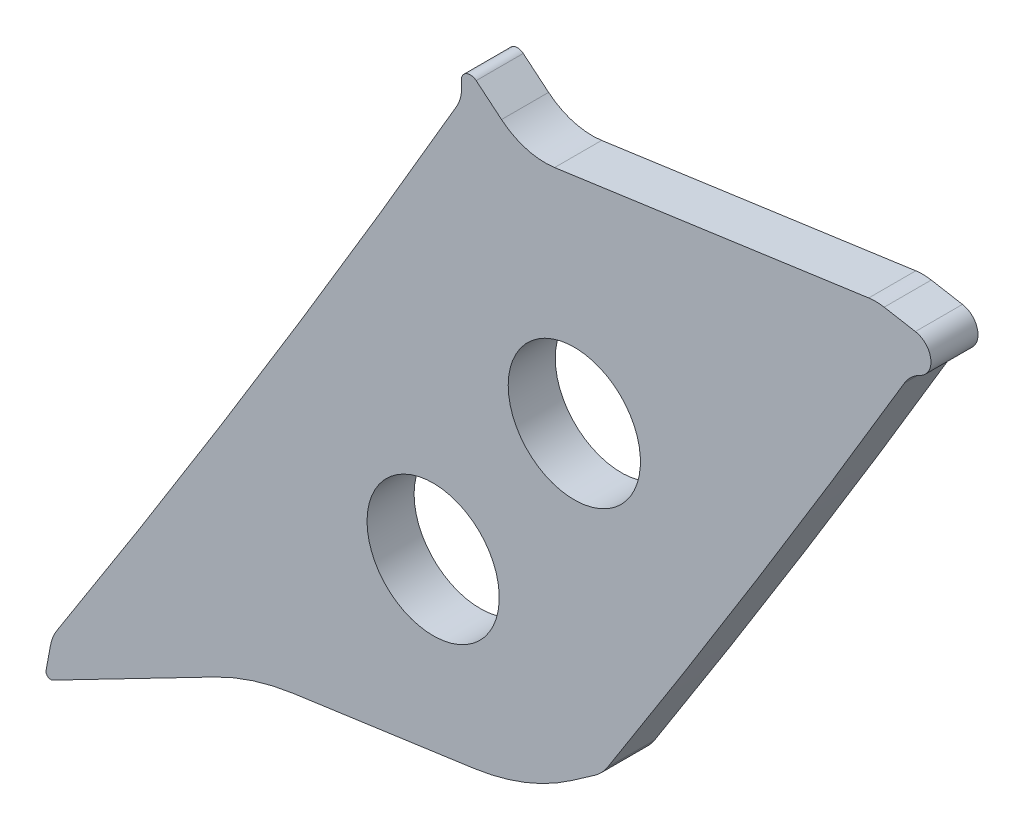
ISO-10303-21;
HEADER;
FILE_DESCRIPTION(('STEP AP214'),'2;1');
FILE_NAME('part.step','',(''),(''),'','','');
FILE_SCHEMA(('AUTOMOTIVE_DESIGN { 1 0 10303 214 1 1 1 1 }'));
ENDSEC;
DATA;
#1=APPLICATION_CONTEXT('core data for automotive mechanical design processes');
#2=APPLICATION_PROTOCOL_DEFINITION('international standard','automotive_design',2000,#1);
#3=PRODUCT_CONTEXT('',#1,'mechanical');
#4=PRODUCT('Part','Part','',(#3));
#5=PRODUCT_RELATED_PRODUCT_CATEGORY('part','',(#4));
#6=PRODUCT_DEFINITION_FORMATION('','',#4);
#7=PRODUCT_DEFINITION_CONTEXT('part definition',#1,'design');
#8=PRODUCT_DEFINITION('design','',#6,#7);
#9=PRODUCT_DEFINITION_SHAPE('','',#8);
#10=(LENGTH_UNIT() NAMED_UNIT(*) SI_UNIT(.MILLI.,.METRE.));
#11=(NAMED_UNIT(*) PLANE_ANGLE_UNIT() SI_UNIT($,.RADIAN.));
#12=(NAMED_UNIT(*) SI_UNIT($,.STERADIAN.) SOLID_ANGLE_UNIT());
#13=UNCERTAINTY_MEASURE_WITH_UNIT(LENGTH_MEASURE(1.E-05),#10,'distance_accuracy_value','');
#14=(GEOMETRIC_REPRESENTATION_CONTEXT(3) GLOBAL_UNCERTAINTY_ASSIGNED_CONTEXT((#13)) GLOBAL_UNIT_ASSIGNED_CONTEXT((#10,
#11,#12)) REPRESENTATION_CONTEXT('',''));
#15=CARTESIAN_POINT('',(0.,0.,0.));
#16=DIRECTION('',(0.,0.,1.));
#17=DIRECTION('',(1.,0.,0.));
#18=AXIS2_PLACEMENT_3D('',#15,#16,#17);
#19=CARTESIAN_POINT('',(-1653.91646147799,487.596028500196,0.));
#20=DIRECTION('',(0.,0.,1.));
#21=DIRECTION('',(1.,0.,0.));
#22=AXIS2_PLACEMENT_3D('',#19,#20,#21);
#23=PLANE('',#22);
#24=CARTESIAN_POINT('',(-904.24,45.72,0.));
#25=DIRECTION('',(0.,0.,-1.));
#26=DIRECTION('',(-1.,0.,0.));
#27=AXIS2_PLACEMENT_3D('',#24,#25,#26);
#28=CIRCLE('',#27,3.56869999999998);
#29=CARTESIAN_POINT('',(-907.8087,45.72,0.));
#30=VERTEX_POINT('',#29);
#31=EDGE_CURVE('E385',#30,#30,#28,.T.);
#32=ORIENTED_EDGE('',*,*,#31,.T.);
#33=EDGE_LOOP('',(#32));
#34=FACE_BOUND('',#33,.T.);
#35=CARTESIAN_POINT('',(-1653.91646147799,487.596028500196,0.));
#36=DIRECTION('',(0.,0.,-1.));
#37=DIRECTION('',(1.,0.,0.));
#38=AXIS2_PLACEMENT_3D('',#35,#36,#37);
#39=CIRCLE('',#38,858.850398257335);
#40=CARTESIAN_POINT('',(-910.59376540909,57.3689069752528,0.));
#41=VERTEX_POINT('',#40);
#42=CARTESIAN_POINT('',(-932.158261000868,22.0972566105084,0.));
#43=VERTEX_POINT('',#42);
#44=EDGE_CURVE('E223',#41,#43,#39,.T.);
#45=ORIENTED_EDGE('',*,*,#44,.T.);
#46=CARTESIAN_POINT('',(-930.023703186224,20.7205711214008,0.));
#47=DIRECTION('',(0.,0.,1.));
#48=DIRECTION('',(1.,0.,0.));
#49=AXIS2_PLACEMENT_3D('',#46,#47,#48);
#50=CIRCLE('',#49,2.53999999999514);
#51=CARTESIAN_POINT('',(-932.521499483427,21.1816716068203,0.));
#52=VERTEX_POINT('',#51);
#53=EDGE_CURVE('E227',#43,#52,#50,.T.);
#54=ORIENTED_EDGE('',*,*,#53,.T.);
#55=DIRECTION('',(-0.181535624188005,-0.98338436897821,0.));
#56=VECTOR('',#55,1.);
#57=CARTESIAN_POINT('',(-932.521499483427,21.1816716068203,0.));
#58=LINE('',#57,#56);
#59=CARTESIAN_POINT('',(-932.753780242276,19.9233991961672,0.));
#60=VERTEX_POINT('',#59);
#61=EDGE_CURVE('E232',#52,#60,#58,.T.);
#62=ORIENTED_EDGE('',*,*,#61,.T.);
#63=CARTESIAN_POINT('',(-932.504000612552,19.877289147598,0.));
#64=DIRECTION('',(0.,0.,1.));
#65=DIRECTION('',(1.,0.,0.));
#66=AXIS2_PLACEMENT_3D('',#63,#64,#65);
#67=CIRCLE('',#66,0.254000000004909);
#68=CARTESIAN_POINT('',(-932.387397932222,19.6516349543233,0.));
#69=VERTEX_POINT('',#68);
#70=EDGE_CURVE('E236',#60,#69,#67,.T.);
#71=ORIENTED_EDGE('',*,*,#70,.T.);
#72=DIRECTION('',(0.888402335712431,0.459065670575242,0.));
#73=VECTOR('',#72,1.);
#74=CARTESIAN_POINT('',(-932.387397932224,19.6516349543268,0.));
#75=LINE('',#74,#73);
#76=CARTESIAN_POINT('',(-923.637335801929,24.1730696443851,0.));
#77=VERTEX_POINT('',#76);
#78=EDGE_CURVE('E240',#69,#77,#75,.T.);
#79=ORIENTED_EDGE('',*,*,#78,.T.);
#80=CARTESIAN_POINT('',(-917.573996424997,12.439051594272,0.));
#81=DIRECTION('',(0.,0.,-1.));
#82=DIRECTION('',(1.,0.,0.));
#83=AXIS2_PLACEMENT_3D('',#80,#81,#82);
#84=CIRCLE('',#83,13.208000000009);
#85=CARTESIAN_POINT('',(-919.412194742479,25.5185122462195,0.));
#86=VERTEX_POINT('',#85);
#87=EDGE_CURVE('E244',#77,#86,#84,.T.);
#88=ORIENTED_EDGE('',*,*,#87,.T.);
#89=DIRECTION('',(0.990268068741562,0.139173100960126,0.));
#90=VECTOR('',#89,1.);
#91=CARTESIAN_POINT('',(-919.412194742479,25.5185122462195,0.));
#92=LINE('',#91,#90);
#93=CARTESIAN_POINT('',(-909.658835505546,26.8892574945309,0.));
#94=VERTEX_POINT('',#93);
#95=EDGE_CURVE('E248',#86,#94,#92,.T.);
#96=ORIENTED_EDGE('',*,*,#95,.T.);
#97=CARTESIAN_POINT('',(-911.355633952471,38.9626057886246,0.));
#98=DIRECTION('',(0.,0.,1.));
#99=DIRECTION('',(1.,0.,0.));
#100=AXIS2_PLACEMENT_3D('',#97,#98,#99);
#101=CIRCLE('',#100,12.1920000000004);
#102=CARTESIAN_POINT('',(-904.388794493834,28.9572066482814,0.));
#103=VERTEX_POINT('',#102);
#104=EDGE_CURVE('E252',#94,#103,#101,.T.);
#105=ORIENTED_EDGE('',*,*,#104,.T.);
#106=DIRECTION('',(0.82065281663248,0.571427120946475,0.));
#107=VECTOR('',#106,1.);
#108=CARTESIAN_POINT('',(-904.388794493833,28.9572066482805,0.));
#109=LINE('',#108,#107);
#110=CARTESIAN_POINT('',(-903.138119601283,29.8280615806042,0.));
#111=VERTEX_POINT('',#110);
#112=EDGE_CURVE('E256',#103,#111,#109,.T.);
#113=ORIENTED_EDGE('',*,*,#112,.T.);
#114=CARTESIAN_POINT('',(-904.589544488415,31.912519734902,0.));
#115=DIRECTION('',(0.,0.,1.));
#116=DIRECTION('',(1.,0.,0.));
#117=AXIS2_PLACEMENT_3D('',#114,#115,#116);
#118=CIRCLE('',#117,2.54000000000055);
#119=CARTESIAN_POINT('',(-902.452304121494,30.5400024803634,0.));
#120=VERTEX_POINT('',#119);
#121=EDGE_CURVE('E260',#111,#120,#118,.T.);
#122=ORIENTED_EDGE('',*,*,#121,.T.);
#123=CARTESIAN_POINT('',(-1614.16546147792,487.596028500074,0.));
#124=DIRECTION('',(0.,0.,1.));
#125=DIRECTION('',(1.,0.,0.));
#126=AXIS2_PLACEMENT_3D('',#123,#124,#125);
#127=CIRCLE('',#126,845.834398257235);
#128=CARTESIAN_POINT('',(-886.424246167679,56.5176680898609,0.));
#129=VERTEX_POINT('',#128);
#130=EDGE_CURVE('E264',#120,#129,#127,.T.);
#131=ORIENTED_EDGE('',*,*,#130,.T.);
#132=CARTESIAN_POINT('',(-884.675948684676,55.4820620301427,0.));
#133=DIRECTION('',(0.,0.,-1.));
#134=DIRECTION('',(1.,0.,0.));
#135=AXIS2_PLACEMENT_3D('',#132,#133,#134);
#136=CIRCLE('',#135,2.03199999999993);
#137=CARTESIAN_POINT('',(-885.56222905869,57.3105945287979,0.));
#138=VERTEX_POINT('',#137);
#139=EDGE_CURVE('E268',#129,#138,#136,.T.);
#140=ORIENTED_EDGE('',*,*,#139,.T.);
#141=CARTESIAN_POINT('',(-886.005369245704,58.2248607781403,0.));
#142=DIRECTION('',(0.,0.,1.));
#143=DIRECTION('',(1.,0.,0.));
#144=AXIS2_PLACEMENT_3D('',#141,#142,#143);
#145=CIRCLE('',#144,1.01600000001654);
#146=CARTESIAN_POINT('',(-885.828942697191,59.225425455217,0.));
#147=VERTEX_POINT('',#146);
#148=EDGE_CURVE('E272',#138,#147,#145,.T.);
#149=ORIENTED_EDGE('',*,*,#148,.T.);
#150=DIRECTION('',(-0.984807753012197,0.173648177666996,0.));
#151=VECTOR('',#150,1.);
#152=CARTESIAN_POINT('',(-885.828942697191,59.225425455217,0.));
#153=LINE('',#152,#151);
#154=CARTESIAN_POINT('',(-887.513635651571,59.5224822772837,0.));
#155=VERTEX_POINT('',#154);
#156=EDGE_CURVE('E276',#147,#155,#153,.T.);
#157=ORIENTED_EDGE('',*,*,#156,.T.);
#158=CARTESIAN_POINT('',(-887.976755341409,56.896,0.));
#159=DIRECTION('',(0.,0.,1.));
#160=DIRECTION('',(1.,0.,0.));
#161=AXIS2_PLACEMENT_3D('',#158,#159,#160);
#162=CIRCLE('',#161,2.66700000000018);
#163=CARTESIAN_POINT('',(-888.34793000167,59.537044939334,0.));
#164=VERTEX_POINT('',#163);
#165=EDGE_CURVE('E280',#155,#164,#162,.T.);
#166=ORIENTED_EDGE('',*,*,#165,.T.);
#167=DIRECTION('',(-0.990268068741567,-0.139173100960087,0.));
#168=VECTOR('',#167,1.);
#169=CARTESIAN_POINT('',(-888.34793000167,59.5370449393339,0.));
#170=LINE('',#169,#168);
#171=CARTESIAN_POINT('',(-905.304187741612,57.1539983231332,0.));
#172=VERTEX_POINT('',#171);
#173=EDGE_CURVE('E284',#164,#172,#170,.T.);
#174=ORIENTED_EDGE('',*,*,#173,.T.);
#175=CARTESIAN_POINT('',(-905.816762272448,60.8011556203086,0.));
#176=DIRECTION('',(0.,0.,-1.));
#177=DIRECTION('',(1.,0.,0.));
#178=AXIS2_PLACEMENT_3D('',#175,#176,#177);
#179=CIRCLE('',#178,3.68299999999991);
#180=CARTESIAN_POINT('',(-908.168482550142,57.9667419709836,0.));
#181=VERTEX_POINT('',#180);
#182=EDGE_CURVE('E288',#172,#181,#179,.T.);
#183=ORIENTED_EDGE('',*,*,#182,.T.);
#184=DIRECTION('',(-0.769593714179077,0.638533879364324,0.));
#185=VECTOR('',#184,1.);
#186=CARTESIAN_POINT('',(-908.168482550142,57.9667419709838,0.));
#187=LINE('',#186,#185);
#188=CARTESIAN_POINT('',(-909.536820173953,59.1020552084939,0.));
#189=VERTEX_POINT('',#188);
#190=EDGE_CURVE('E292',#181,#189,#187,.T.);
#191=ORIENTED_EDGE('',*,*,#190,.T.);
#192=CARTESIAN_POINT('',(-909.850978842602,58.7234151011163,0.));
#193=DIRECTION('',(0.,0.,1.));
#194=DIRECTION('',(1.,0.,0.));
#195=AXIS2_PLACEMENT_3D('',#192,#193,#194);
#196=CIRCLE('',#195,0.492000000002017);
#197=CARTESIAN_POINT('',(-910.33858386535,58.6577999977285,0.));
#198=VERTEX_POINT('',#197);
#199=EDGE_CURVE('E193',#189,#198,#196,.T.);
#200=ORIENTED_EDGE('',*,*,#199,.T.);
#201=CARTESIAN_POINT('',(-912.35243225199,58.3868042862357,0.));
#202=DIRECTION('',(0.,0.,-1.));
#203=DIRECTION('',(1.,0.,0.));
#204=AXIS2_PLACEMENT_3D('',#201,#202,#203);
#205=CIRCLE('',#204,2.03200000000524);
#206=EDGE_CURVE('E297',#198,#41,#205,.T.);
#207=ORIENTED_EDGE('',*,*,#206,.T.);
#208=EDGE_LOOP('',(#45,#54,#62,#71,#79,#88,#96,#105,#113,#122,#131,#140,#149,#157,#166,#174,
#183,#191,#200,#207));
#209=FACE_BOUND('',#208,.T.);
#210=CARTESIAN_POINT('',(-911.86,35.56,0.));
#211=DIRECTION('',(0.,0.,-1.));
#212=DIRECTION('',(-1.,0.,0.));
#213=AXIS2_PLACEMENT_3D('',#210,#211,#212);
#214=CIRCLE('',#213,3.56869999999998);
#215=CARTESIAN_POINT('',(-915.4287,35.56,0.));
#216=VERTEX_POINT('',#215);
#217=EDGE_CURVE('E390',#216,#216,#214,.T.);
#218=ORIENTED_EDGE('',*,*,#217,.T.);
#219=EDGE_LOOP('',(#218));
#220=FACE_BOUND('',#219,.T.);
#221=ADVANCED_FACE('F45',(#34,#209,#220),#23,.T.);
#222=CARTESIAN_POINT('',(-1653.91646147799,487.596028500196,-2.54));
#223=DIRECTION('',(0.,0.,1.));
#224=DIRECTION('',(1.,0.,0.));
#225=AXIS2_PLACEMENT_3D('',#222,#223,#224);
#226=PLANE('',#225);
#227=CARTESIAN_POINT('',(-904.24,45.72,-2.54));
#228=DIRECTION('',(0.,0.,-1.));
#229=DIRECTION('',(-1.,0.,0.));
#230=AXIS2_PLACEMENT_3D('',#227,#228,#229);
#231=CIRCLE('',#230,3.56869999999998);
#232=CARTESIAN_POINT('',(-907.8087,45.72,-2.54));
#233=VERTEX_POINT('',#232);
#234=EDGE_CURVE('E388',#233,#233,#231,.T.);
#235=ORIENTED_EDGE('',*,*,#234,.F.);
#236=EDGE_LOOP('',(#235));
#237=FACE_BOUND('',#236,.T.);
#238=CARTESIAN_POINT('',(-1653.91646147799,487.596028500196,-2.54));
#239=DIRECTION('',(0.,0.,-1.));
#240=DIRECTION('',(1.,0.,0.));
#241=AXIS2_PLACEMENT_3D('',#238,#239,#240);
#242=CIRCLE('',#241,858.850398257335);
#243=CARTESIAN_POINT('',(-910.59376540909,57.3689069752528,-2.54));
#244=VERTEX_POINT('',#243);
#245=CARTESIAN_POINT('',(-932.158261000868,22.0972566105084,-2.54));
#246=VERTEX_POINT('',#245);
#247=EDGE_CURVE('E300',#244,#246,#242,.T.);
#248=ORIENTED_EDGE('',*,*,#247,.F.);
#249=CARTESIAN_POINT('',(-912.35243225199,58.3868042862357,-2.54));
#250=DIRECTION('',(0.,0.,-1.));
#251=DIRECTION('',(1.,0.,0.));
#252=AXIS2_PLACEMENT_3D('',#249,#250,#251);
#253=CIRCLE('',#252,2.03200000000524);
#254=CARTESIAN_POINT('',(-910.33858386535,58.6577999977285,-2.54));
#255=VERTEX_POINT('',#254);
#256=EDGE_CURVE('E208',#255,#244,#253,.T.);
#257=ORIENTED_EDGE('',*,*,#256,.F.);
#258=CARTESIAN_POINT('',(-909.850978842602,58.7234151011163,-2.54));
#259=DIRECTION('',(0.,0.,1.));
#260=DIRECTION('',(1.,0.,0.));
#261=AXIS2_PLACEMENT_3D('',#258,#259,#260);
#262=CIRCLE('',#261,0.492000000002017);
#263=CARTESIAN_POINT('',(-909.536820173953,59.1020552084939,-2.54));
#264=VERTEX_POINT('',#263);
#265=EDGE_CURVE('E191',#264,#255,#262,.T.);
#266=ORIENTED_EDGE('',*,*,#265,.F.);
#267=DIRECTION('',(-0.769593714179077,0.638533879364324,0.));
#268=VECTOR('',#267,1.);
#269=CARTESIAN_POINT('',(-908.168482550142,57.9667419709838,-2.54));
#270=LINE('',#269,#268);
#271=CARTESIAN_POINT('',(-908.168482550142,57.9667419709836,-2.54));
#272=VERTEX_POINT('',#271);
#273=EDGE_CURVE('E206',#272,#264,#270,.T.);
#274=ORIENTED_EDGE('',*,*,#273,.F.);
#275=CARTESIAN_POINT('',(-905.816762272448,60.8011556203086,-2.54));
#276=DIRECTION('',(0.,0.,-1.));
#277=DIRECTION('',(1.,0.,0.));
#278=AXIS2_PLACEMENT_3D('',#275,#276,#277);
#279=CIRCLE('',#278,3.68299999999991);
#280=CARTESIAN_POINT('',(-905.304187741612,57.1539983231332,-2.54));
#281=VERTEX_POINT('',#280);
#282=EDGE_CURVE('E213',#281,#272,#279,.T.);
#283=ORIENTED_EDGE('',*,*,#282,.F.);
#284=DIRECTION('',(-0.990268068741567,-0.139173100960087,0.));
#285=VECTOR('',#284,1.);
#286=CARTESIAN_POINT('',(-888.34793000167,59.5370449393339,-2.54));
#287=LINE('',#286,#285);
#288=CARTESIAN_POINT('',(-888.34793000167,59.537044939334,-2.54));
#289=VERTEX_POINT('',#288);
#290=EDGE_CURVE('E217',#289,#281,#287,.T.);
#291=ORIENTED_EDGE('',*,*,#290,.F.);
#292=CARTESIAN_POINT('',(-887.976755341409,56.896,-2.54));
#293=DIRECTION('',(0.,0.,1.));
#294=DIRECTION('',(1.,0.,0.));
#295=AXIS2_PLACEMENT_3D('',#292,#293,#294);
#296=CIRCLE('',#295,2.66700000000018);
#297=CARTESIAN_POINT('',(-887.513635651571,59.5224822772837,-2.54));
#298=VERTEX_POINT('',#297);
#299=EDGE_CURVE('E455',#298,#289,#296,.T.);
#300=ORIENTED_EDGE('',*,*,#299,.F.);
#301=DIRECTION('',(-0.984807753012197,0.173648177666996,0.));
#302=VECTOR('',#301,1.);
#303=CARTESIAN_POINT('',(-885.828942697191,59.225425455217,-2.54));
#304=LINE('',#303,#302);
#305=CARTESIAN_POINT('',(-885.828942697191,59.225425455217,-2.54));
#306=VERTEX_POINT('',#305);
#307=EDGE_CURVE('E451',#306,#298,#304,.T.);
#308=ORIENTED_EDGE('',*,*,#307,.F.);
#309=CARTESIAN_POINT('',(-886.005369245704,58.2248607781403,-2.54));
#310=DIRECTION('',(0.,0.,1.));
#311=DIRECTION('',(1.,0.,0.));
#312=AXIS2_PLACEMENT_3D('',#309,#310,#311);
#313=CIRCLE('',#312,1.01600000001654);
#314=CARTESIAN_POINT('',(-885.56222905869,57.3105945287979,-2.54));
#315=VERTEX_POINT('',#314);
#316=EDGE_CURVE('E447',#315,#306,#313,.T.);
#317=ORIENTED_EDGE('',*,*,#316,.F.);
#318=CARTESIAN_POINT('',(-884.675948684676,55.4820620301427,-2.54));
#319=DIRECTION('',(0.,0.,-1.));
#320=DIRECTION('',(1.,0.,0.));
#321=AXIS2_PLACEMENT_3D('',#318,#319,#320);
#322=CIRCLE('',#321,2.03199999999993);
#323=CARTESIAN_POINT('',(-886.424246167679,56.5176680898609,-2.54));
#324=VERTEX_POINT('',#323);
#325=EDGE_CURVE('E443',#324,#315,#322,.T.);
#326=ORIENTED_EDGE('',*,*,#325,.F.);
#327=CARTESIAN_POINT('',(-1614.16546147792,487.596028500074,-2.54));
#328=DIRECTION('',(0.,0.,1.));
#329=DIRECTION('',(1.,0.,0.));
#330=AXIS2_PLACEMENT_3D('',#327,#328,#329);
#331=CIRCLE('',#330,845.834398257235);
#332=CARTESIAN_POINT('',(-902.452304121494,30.5400024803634,-2.54));
#333=VERTEX_POINT('',#332);
#334=EDGE_CURVE('E439',#333,#324,#331,.T.);
#335=ORIENTED_EDGE('',*,*,#334,.F.);
#336=CARTESIAN_POINT('',(-904.589544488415,31.912519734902,-2.54));
#337=DIRECTION('',(0.,0.,1.));
#338=DIRECTION('',(1.,0.,0.));
#339=AXIS2_PLACEMENT_3D('',#336,#337,#338);
#340=CIRCLE('',#339,2.54000000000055);
#341=CARTESIAN_POINT('',(-903.138119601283,29.8280615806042,-2.54));
#342=VERTEX_POINT('',#341);
#343=EDGE_CURVE('E435',#342,#333,#340,.T.);
#344=ORIENTED_EDGE('',*,*,#343,.F.);
#345=DIRECTION('',(0.82065281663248,0.571427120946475,0.));
#346=VECTOR('',#345,1.);
#347=CARTESIAN_POINT('',(-904.388794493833,28.9572066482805,-2.54));
#348=LINE('',#347,#346);
#349=CARTESIAN_POINT('',(-904.388794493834,28.9572066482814,-2.54));
#350=VERTEX_POINT('',#349);
#351=EDGE_CURVE('E431',#350,#342,#348,.T.);
#352=ORIENTED_EDGE('',*,*,#351,.F.);
#353=CARTESIAN_POINT('',(-911.355633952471,38.9626057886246,-2.54));
#354=DIRECTION('',(0.,0.,1.));
#355=DIRECTION('',(1.,0.,0.));
#356=AXIS2_PLACEMENT_3D('',#353,#354,#355);
#357=CIRCLE('',#356,12.1920000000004);
#358=CARTESIAN_POINT('',(-909.658835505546,26.8892574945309,-2.54));
#359=VERTEX_POINT('',#358);
#360=EDGE_CURVE('E427',#359,#350,#357,.T.);
#361=ORIENTED_EDGE('',*,*,#360,.F.);
#362=DIRECTION('',(0.990268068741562,0.139173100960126,0.));
#363=VECTOR('',#362,1.);
#364=CARTESIAN_POINT('',(-919.412194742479,25.5185122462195,-2.54));
#365=LINE('',#364,#363);
#366=CARTESIAN_POINT('',(-919.412194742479,25.5185122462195,-2.54));
#367=VERTEX_POINT('',#366);
#368=EDGE_CURVE('E423',#367,#359,#365,.T.);
#369=ORIENTED_EDGE('',*,*,#368,.F.);
#370=CARTESIAN_POINT('',(-917.573996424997,12.439051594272,-2.54));
#371=DIRECTION('',(0.,0.,-1.));
#372=DIRECTION('',(1.,0.,0.));
#373=AXIS2_PLACEMENT_3D('',#370,#371,#372);
#374=CIRCLE('',#373,13.208000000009);
#375=CARTESIAN_POINT('',(-923.637335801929,24.1730696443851,-2.54));
#376=VERTEX_POINT('',#375);
#377=EDGE_CURVE('E419',#376,#367,#374,.T.);
#378=ORIENTED_EDGE('',*,*,#377,.F.);
#379=DIRECTION('',(0.888402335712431,0.459065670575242,0.));
#380=VECTOR('',#379,1.);
#381=CARTESIAN_POINT('',(-932.387397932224,19.6516349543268,-2.54));
#382=LINE('',#381,#380);
#383=CARTESIAN_POINT('',(-932.387397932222,19.6516349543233,-2.54));
#384=VERTEX_POINT('',#383);
#385=EDGE_CURVE('E415',#384,#376,#382,.T.);
#386=ORIENTED_EDGE('',*,*,#385,.F.);
#387=CARTESIAN_POINT('',(-932.504000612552,19.877289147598,-2.54));
#388=DIRECTION('',(0.,0.,1.));
#389=DIRECTION('',(1.,0.,0.));
#390=AXIS2_PLACEMENT_3D('',#387,#388,#389);
#391=CIRCLE('',#390,0.254000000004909);
#392=CARTESIAN_POINT('',(-932.753780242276,19.9233991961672,-2.54));
#393=VERTEX_POINT('',#392);
#394=EDGE_CURVE('E411',#393,#384,#391,.T.);
#395=ORIENTED_EDGE('',*,*,#394,.F.);
#396=DIRECTION('',(-0.181535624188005,-0.98338436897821,0.));
#397=VECTOR('',#396,1.);
#398=CARTESIAN_POINT('',(-932.521499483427,21.1816716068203,-2.54));
#399=LINE('',#398,#397);
#400=CARTESIAN_POINT('',(-932.521499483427,21.1816716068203,-2.54));
#401=VERTEX_POINT('',#400);
#402=EDGE_CURVE('E407',#401,#393,#399,.T.);
#403=ORIENTED_EDGE('',*,*,#402,.F.);
#404=CARTESIAN_POINT('',(-930.023703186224,20.7205711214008,-2.54));
#405=DIRECTION('',(0.,0.,1.));
#406=DIRECTION('',(1.,0.,0.));
#407=AXIS2_PLACEMENT_3D('',#404,#405,#406);
#408=CIRCLE('',#407,2.53999999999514);
#409=EDGE_CURVE('E404',#246,#401,#408,.T.);
#410=ORIENTED_EDGE('',*,*,#409,.F.);
#411=EDGE_LOOP('',(#248,#257,#266,#274,#283,#291,#300,#308,#317,#326,#335,#344,#352,#361,#369,
#378,#386,#395,#403,#410));
#412=FACE_BOUND('',#411,.T.);
#413=CARTESIAN_POINT('',(-911.86,35.56,-2.54));
#414=DIRECTION('',(0.,0.,-1.));
#415=DIRECTION('',(-1.,0.,0.));
#416=AXIS2_PLACEMENT_3D('',#413,#414,#415);
#417=CIRCLE('',#416,3.56869999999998);
#418=CARTESIAN_POINT('',(-915.4287,35.56,-2.54));
#419=VERTEX_POINT('',#418);
#420=EDGE_CURVE('E228',#419,#419,#417,.T.);
#421=ORIENTED_EDGE('',*,*,#420,.F.);
#422=EDGE_LOOP('',(#421));
#423=FACE_BOUND('',#422,.T.);
#424=ADVANCED_FACE('F203',(#237,#412,#423),#226,.F.);
#425=CARTESIAN_POINT('',(-1653.91646147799,487.596028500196,-2.54));
#426=DIRECTION('',(0.,0.,1.));
#427=DIRECTION('',(1.,0.,0.));
#428=AXIS2_PLACEMENT_3D('',#425,#426,#427);
#429=CYLINDRICAL_SURFACE('',#428,858.850398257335);
#430=ORIENTED_EDGE('',*,*,#44,.F.);
#431=DIRECTION('',(0.,0.,1.));
#432=VECTOR('',#431,1.);
#433=CARTESIAN_POINT('',(-910.59376540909,57.3689069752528,-2.54));
#434=LINE('',#433,#432);
#435=EDGE_CURVE('E11',#244,#41,#434,.T.);
#436=ORIENTED_EDGE('',*,*,#435,.F.);
#437=ORIENTED_EDGE('',*,*,#247,.T.);
#438=DIRECTION('',(0.,0.,1.));
#439=VECTOR('',#438,1.);
#440=CARTESIAN_POINT('',(-932.158261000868,22.0972566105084,-2.54));
#441=LINE('',#440,#439);
#442=EDGE_CURVE('E49',#246,#43,#441,.T.);
#443=ORIENTED_EDGE('',*,*,#442,.T.);
#444=EDGE_LOOP('',(#430,#436,#437,#443));
#445=FACE_BOUND('',#444,.T.);
#446=ADVANCED_FACE('F47',(#445),#429,.F.);
#447=CARTESIAN_POINT('',(-912.35243225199,58.3868042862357,-2.54));
#448=DIRECTION('',(0.,0.,1.));
#449=DIRECTION('',(1.,0.,0.));
#450=AXIS2_PLACEMENT_3D('',#447,#448,#449);
#451=CYLINDRICAL_SURFACE('',#450,2.03200000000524);
#452=ORIENTED_EDGE('',*,*,#206,.F.);
#453=DIRECTION('',(0.,0.,1.));
#454=VECTOR('',#453,1.);
#455=CARTESIAN_POINT('',(-910.33858386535,58.6577999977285,-2.54));
#456=LINE('',#455,#454);
#457=EDGE_CURVE('E56',#255,#198,#456,.T.);
#458=ORIENTED_EDGE('',*,*,#457,.F.);
#459=ORIENTED_EDGE('',*,*,#256,.T.);
#460=ORIENTED_EDGE('',*,*,#435,.T.);
#461=EDGE_LOOP('',(#452,#458,#459,#460));
#462=FACE_BOUND('',#461,.T.);
#463=ADVANCED_FACE('F356',(#462),#451,.F.);
#464=CARTESIAN_POINT('',(-909.850978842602,58.7234151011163,-2.54));
#465=DIRECTION('',(0.,0.,1.));
#466=DIRECTION('',(1.,0.,0.));
#467=AXIS2_PLACEMENT_3D('',#464,#465,#466);
#468=CYLINDRICAL_SURFACE('',#467,0.492000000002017);
#469=ORIENTED_EDGE('',*,*,#199,.F.);
#470=DIRECTION('',(0.,0.,1.));
#471=VECTOR('',#470,1.);
#472=CARTESIAN_POINT('',(-909.536820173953,59.1020552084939,-2.54));
#473=LINE('',#472,#471);
#474=EDGE_CURVE('E188',#264,#189,#473,.T.);
#475=ORIENTED_EDGE('',*,*,#474,.F.);
#476=ORIENTED_EDGE('',*,*,#265,.T.);
#477=ORIENTED_EDGE('',*,*,#457,.T.);
#478=EDGE_LOOP('',(#469,#475,#476,#477));
#479=FACE_BOUND('',#478,.T.);
#480=ADVANCED_FACE('F190',(#479),#468,.T.);
#481=CARTESIAN_POINT('',(-908.168482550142,57.9667419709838,-2.54));
#482=DIRECTION('',(0.638533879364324,0.769593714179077,0.));
#483=DIRECTION('',(-0.769593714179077,0.638533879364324,0.));
#484=AXIS2_PLACEMENT_3D('',#481,#482,#483);
#485=PLANE('',#484);
#486=ORIENTED_EDGE('',*,*,#190,.F.);
#487=DIRECTION('',(0.,0.,1.));
#488=VECTOR('',#487,1.);
#489=CARTESIAN_POINT('',(-908.168482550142,57.9667419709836,-2.54));
#490=LINE('',#489,#488);
#491=EDGE_CURVE('E199',#272,#181,#490,.T.);
#492=ORIENTED_EDGE('',*,*,#491,.F.);
#493=ORIENTED_EDGE('',*,*,#273,.T.);
#494=ORIENTED_EDGE('',*,*,#474,.T.);
#495=EDGE_LOOP('',(#486,#492,#493,#494));
#496=FACE_BOUND('',#495,.T.);
#497=ADVANCED_FACE('F211',(#496),#485,.T.);
#498=CARTESIAN_POINT('',(-905.816762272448,60.8011556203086,-2.54));
#499=DIRECTION('',(0.,0.,1.));
#500=DIRECTION('',(1.,0.,0.));
#501=AXIS2_PLACEMENT_3D('',#498,#499,#500);
#502=CYLINDRICAL_SURFACE('',#501,3.68299999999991);
#503=ORIENTED_EDGE('',*,*,#182,.F.);
#504=DIRECTION('',(0.,0.,1.));
#505=VECTOR('',#504,1.);
#506=CARTESIAN_POINT('',(-905.304187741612,57.1539983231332,-2.54));
#507=LINE('',#506,#505);
#508=EDGE_CURVE('E306',#281,#172,#507,.T.);
#509=ORIENTED_EDGE('',*,*,#508,.F.);
#510=ORIENTED_EDGE('',*,*,#282,.T.);
#511=ORIENTED_EDGE('',*,*,#491,.T.);
#512=EDGE_LOOP('',(#503,#509,#510,#511));
#513=FACE_BOUND('',#512,.T.);
#514=ADVANCED_FACE('F518',(#513),#502,.F.);
#515=CARTESIAN_POINT('',(-888.34793000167,59.5370449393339,-2.54));
#516=DIRECTION('',(-0.139173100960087,0.990268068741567,0.));
#517=DIRECTION('',(-0.990268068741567,-0.139173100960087,0.));
#518=AXIS2_PLACEMENT_3D('',#515,#516,#517);
#519=PLANE('',#518);
#520=ORIENTED_EDGE('',*,*,#173,.F.);
#521=DIRECTION('',(0.,0.,1.));
#522=VECTOR('',#521,1.);
#523=CARTESIAN_POINT('',(-888.34793000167,59.537044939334,-2.54));
#524=LINE('',#523,#522);
#525=EDGE_CURVE('E309',#289,#164,#524,.T.);
#526=ORIENTED_EDGE('',*,*,#525,.F.);
#527=ORIENTED_EDGE('',*,*,#290,.T.);
#528=ORIENTED_EDGE('',*,*,#508,.T.);
#529=EDGE_LOOP('',(#520,#526,#527,#528));
#530=FACE_BOUND('',#529,.T.);
#531=ADVANCED_FACE('F464',(#530),#519,.T.);
#532=CARTESIAN_POINT('',(-887.976755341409,56.896,-2.54));
#533=DIRECTION('',(0.,0.,1.));
#534=DIRECTION('',(1.,0.,0.));
#535=AXIS2_PLACEMENT_3D('',#532,#533,#534);
#536=CYLINDRICAL_SURFACE('',#535,2.66700000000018);
#537=ORIENTED_EDGE('',*,*,#165,.F.);
#538=DIRECTION('',(0.,0.,1.));
#539=VECTOR('',#538,1.);
#540=CARTESIAN_POINT('',(-887.513635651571,59.5224822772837,-2.54));
#541=LINE('',#540,#539);
#542=EDGE_CURVE('E312',#298,#155,#541,.T.);
#543=ORIENTED_EDGE('',*,*,#542,.F.);
#544=ORIENTED_EDGE('',*,*,#299,.T.);
#545=ORIENTED_EDGE('',*,*,#525,.T.);
#546=EDGE_LOOP('',(#537,#543,#544,#545));
#547=FACE_BOUND('',#546,.T.);
#548=ADVANCED_FACE('F470',(#547),#536,.T.);
#549=CARTESIAN_POINT('',(-885.828942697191,59.225425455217,-2.54));
#550=DIRECTION('',(0.173648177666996,0.984807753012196,0.));
#551=DIRECTION('',(-0.984807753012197,0.173648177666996,0.));
#552=AXIS2_PLACEMENT_3D('',#549,#550,#551);
#553=PLANE('',#552);
#554=ORIENTED_EDGE('',*,*,#156,.F.);
#555=DIRECTION('',(0.,0.,1.));
#556=VECTOR('',#555,1.);
#557=CARTESIAN_POINT('',(-885.828942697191,59.225425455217,-2.54));
#558=LINE('',#557,#556);
#559=EDGE_CURVE('E315',#306,#147,#558,.T.);
#560=ORIENTED_EDGE('',*,*,#559,.F.);
#561=ORIENTED_EDGE('',*,*,#307,.T.);
#562=ORIENTED_EDGE('',*,*,#542,.T.);
#563=EDGE_LOOP('',(#554,#560,#561,#562));
#564=FACE_BOUND('',#563,.T.);
#565=ADVANCED_FACE('F473',(#564),#553,.T.);
#566=CARTESIAN_POINT('',(-886.005369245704,58.2248607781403,-2.54));
#567=DIRECTION('',(0.,0.,1.));
#568=DIRECTION('',(1.,0.,0.));
#569=AXIS2_PLACEMENT_3D('',#566,#567,#568);
#570=CYLINDRICAL_SURFACE('',#569,1.01600000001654);
#571=ORIENTED_EDGE('',*,*,#148,.F.);
#572=DIRECTION('',(0.,0.,1.));
#573=VECTOR('',#572,1.);
#574=CARTESIAN_POINT('',(-885.56222905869,57.3105945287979,-2.54));
#575=LINE('',#574,#573);
#576=EDGE_CURVE('E318',#315,#138,#575,.T.);
#577=ORIENTED_EDGE('',*,*,#576,.F.);
#578=ORIENTED_EDGE('',*,*,#316,.T.);
#579=ORIENTED_EDGE('',*,*,#559,.T.);
#580=EDGE_LOOP('',(#571,#577,#578,#579));
#581=FACE_BOUND('',#580,.T.);
#582=ADVANCED_FACE('F478',(#581),#570,.T.);
#583=CARTESIAN_POINT('',(-884.675948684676,55.4820620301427,-2.54));
#584=DIRECTION('',(0.,0.,1.));
#585=DIRECTION('',(1.,0.,0.));
#586=AXIS2_PLACEMENT_3D('',#583,#584,#585);
#587=CYLINDRICAL_SURFACE('',#586,2.03199999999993);
#588=ORIENTED_EDGE('',*,*,#139,.F.);
#589=DIRECTION('',(0.,0.,1.));
#590=VECTOR('',#589,1.);
#591=CARTESIAN_POINT('',(-886.424246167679,56.5176680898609,-2.54));
#592=LINE('',#591,#590);
#593=EDGE_CURVE('E321',#324,#129,#592,.T.);
#594=ORIENTED_EDGE('',*,*,#593,.F.);
#595=ORIENTED_EDGE('',*,*,#325,.T.);
#596=ORIENTED_EDGE('',*,*,#576,.T.);
#597=EDGE_LOOP('',(#588,#594,#595,#596));
#598=FACE_BOUND('',#597,.T.);
#599=ADVANCED_FACE('F481',(#598),#587,.F.);
#600=CARTESIAN_POINT('',(-1614.16546147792,487.596028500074,-2.54));
#601=DIRECTION('',(0.,0.,1.));
#602=DIRECTION('',(1.,0.,0.));
#603=AXIS2_PLACEMENT_3D('',#600,#601,#602);
#604=CYLINDRICAL_SURFACE('',#603,845.834398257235);
#605=ORIENTED_EDGE('',*,*,#130,.F.);
#606=DIRECTION('',(0.,0.,1.));
#607=VECTOR('',#606,1.);
#608=CARTESIAN_POINT('',(-902.452304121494,30.5400024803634,-2.54));
#609=LINE('',#608,#607);
#610=EDGE_CURVE('E324',#333,#120,#609,.T.);
#611=ORIENTED_EDGE('',*,*,#610,.F.);
#612=ORIENTED_EDGE('',*,*,#334,.T.);
#613=ORIENTED_EDGE('',*,*,#593,.T.);
#614=EDGE_LOOP('',(#605,#611,#612,#613));
#615=FACE_BOUND('',#614,.T.);
#616=ADVANCED_FACE('F486',(#615),#604,.T.);
#617=CARTESIAN_POINT('',(-904.589544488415,31.912519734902,-2.54));
#618=DIRECTION('',(0.,0.,1.));
#619=DIRECTION('',(1.,0.,0.));
#620=AXIS2_PLACEMENT_3D('',#617,#618,#619);
#621=CYLINDRICAL_SURFACE('',#620,2.54000000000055);
#622=ORIENTED_EDGE('',*,*,#121,.F.);
#623=DIRECTION('',(0.,0.,1.));
#624=VECTOR('',#623,1.);
#625=CARTESIAN_POINT('',(-903.138119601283,29.8280615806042,-2.54));
#626=LINE('',#625,#624);
#627=EDGE_CURVE('E327',#342,#111,#626,.T.);
#628=ORIENTED_EDGE('',*,*,#627,.F.);
#629=ORIENTED_EDGE('',*,*,#343,.T.);
#630=ORIENTED_EDGE('',*,*,#610,.T.);
#631=EDGE_LOOP('',(#622,#628,#629,#630));
#632=FACE_BOUND('',#631,.T.);
#633=ADVANCED_FACE('F489',(#632),#621,.T.);
#634=CARTESIAN_POINT('',(-904.388794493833,28.9572066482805,-2.54));
#635=DIRECTION('',(0.571427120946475,-0.82065281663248,0.));
#636=DIRECTION('',(0.82065281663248,0.571427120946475,0.));
#637=AXIS2_PLACEMENT_3D('',#634,#635,#636);
#638=PLANE('',#637);
#639=ORIENTED_EDGE('',*,*,#112,.F.);
#640=DIRECTION('',(0.,0.,1.));
#641=VECTOR('',#640,1.);
#642=CARTESIAN_POINT('',(-904.388794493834,28.9572066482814,-2.54));
#643=LINE('',#642,#641);
#644=EDGE_CURVE('E330',#350,#103,#643,.T.);
#645=ORIENTED_EDGE('',*,*,#644,.F.);
#646=ORIENTED_EDGE('',*,*,#351,.T.);
#647=ORIENTED_EDGE('',*,*,#627,.T.);
#648=EDGE_LOOP('',(#639,#645,#646,#647));
#649=FACE_BOUND('',#648,.T.);
#650=ADVANCED_FACE('F494',(#649),#638,.T.);
#651=CARTESIAN_POINT('',(-911.355633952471,38.9626057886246,-2.54));
#652=DIRECTION('',(0.,0.,1.));
#653=DIRECTION('',(1.,0.,0.));
#654=AXIS2_PLACEMENT_3D('',#651,#652,#653);
#655=CYLINDRICAL_SURFACE('',#654,12.1920000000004);
#656=ORIENTED_EDGE('',*,*,#104,.F.);
#657=DIRECTION('',(0.,0.,1.));
#658=VECTOR('',#657,1.);
#659=CARTESIAN_POINT('',(-909.658835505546,26.8892574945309,-2.54));
#660=LINE('',#659,#658);
#661=EDGE_CURVE('E333',#359,#94,#660,.T.);
#662=ORIENTED_EDGE('',*,*,#661,.F.);
#663=ORIENTED_EDGE('',*,*,#360,.T.);
#664=ORIENTED_EDGE('',*,*,#644,.T.);
#665=EDGE_LOOP('',(#656,#662,#663,#664));
#666=FACE_BOUND('',#665,.T.);
#667=ADVANCED_FACE('F497',(#666),#655,.T.);
#668=CARTESIAN_POINT('',(-919.412194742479,25.5185122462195,-2.54));
#669=DIRECTION('',(0.139173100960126,-0.990268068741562,0.));
#670=DIRECTION('',(0.990268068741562,0.139173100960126,0.));
#671=AXIS2_PLACEMENT_3D('',#668,#669,#670);
#672=PLANE('',#671);
#673=ORIENTED_EDGE('',*,*,#95,.F.);
#674=DIRECTION('',(0.,0.,1.));
#675=VECTOR('',#674,1.);
#676=CARTESIAN_POINT('',(-919.412194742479,25.5185122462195,-2.54));
#677=LINE('',#676,#675);
#678=EDGE_CURVE('E336',#367,#86,#677,.T.);
#679=ORIENTED_EDGE('',*,*,#678,.F.);
#680=ORIENTED_EDGE('',*,*,#368,.T.);
#681=ORIENTED_EDGE('',*,*,#661,.T.);
#682=EDGE_LOOP('',(#673,#679,#680,#681));
#683=FACE_BOUND('',#682,.T.);
#684=ADVANCED_FACE('F502',(#683),#672,.T.);
#685=CARTESIAN_POINT('',(-917.573996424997,12.439051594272,-2.54));
#686=DIRECTION('',(0.,0.,1.));
#687=DIRECTION('',(1.,0.,0.));
#688=AXIS2_PLACEMENT_3D('',#685,#686,#687);
#689=CYLINDRICAL_SURFACE('',#688,13.208000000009);
#690=ORIENTED_EDGE('',*,*,#87,.F.);
#691=DIRECTION('',(0.,0.,1.));
#692=VECTOR('',#691,1.);
#693=CARTESIAN_POINT('',(-923.637335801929,24.1730696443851,-2.54));
#694=LINE('',#693,#692);
#695=EDGE_CURVE('E339',#376,#77,#694,.T.);
#696=ORIENTED_EDGE('',*,*,#695,.F.);
#697=ORIENTED_EDGE('',*,*,#377,.T.);
#698=ORIENTED_EDGE('',*,*,#678,.T.);
#699=EDGE_LOOP('',(#690,#696,#697,#698));
#700=FACE_BOUND('',#699,.T.);
#701=ADVANCED_FACE('F505',(#700),#689,.F.);
#702=CARTESIAN_POINT('',(-932.387397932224,19.6516349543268,-2.54));
#703=DIRECTION('',(0.459065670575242,-0.888402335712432,0.));
#704=DIRECTION('',(0.888402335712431,0.459065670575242,0.));
#705=AXIS2_PLACEMENT_3D('',#702,#703,#704);
#706=PLANE('',#705);
#707=ORIENTED_EDGE('',*,*,#78,.F.);
#708=DIRECTION('',(0.,0.,1.));
#709=VECTOR('',#708,1.);
#710=CARTESIAN_POINT('',(-932.387397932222,19.6516349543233,-2.54));
#711=LINE('',#710,#709);
#712=EDGE_CURVE('E342',#384,#69,#711,.T.);
#713=ORIENTED_EDGE('',*,*,#712,.F.);
#714=ORIENTED_EDGE('',*,*,#385,.T.);
#715=ORIENTED_EDGE('',*,*,#695,.T.);
#716=EDGE_LOOP('',(#707,#713,#714,#715));
#717=FACE_BOUND('',#716,.T.);
#718=ADVANCED_FACE('F510',(#717),#706,.T.);
#719=CARTESIAN_POINT('',(-932.504000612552,19.877289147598,-2.54));
#720=DIRECTION('',(0.,0.,1.));
#721=DIRECTION('',(1.,0.,0.));
#722=AXIS2_PLACEMENT_3D('',#719,#720,#721);
#723=CYLINDRICAL_SURFACE('',#722,0.254000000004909);
#724=ORIENTED_EDGE('',*,*,#70,.F.);
#725=DIRECTION('',(0.,0.,1.));
#726=VECTOR('',#725,1.);
#727=CARTESIAN_POINT('',(-932.753780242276,19.9233991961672,-2.54));
#728=LINE('',#727,#726);
#729=EDGE_CURVE('E345',#393,#60,#728,.T.);
#730=ORIENTED_EDGE('',*,*,#729,.F.);
#731=ORIENTED_EDGE('',*,*,#394,.T.);
#732=ORIENTED_EDGE('',*,*,#712,.T.);
#733=EDGE_LOOP('',(#724,#730,#731,#732));
#734=FACE_BOUND('',#733,.T.);
#735=ADVANCED_FACE('F513',(#734),#723,.T.);
#736=CARTESIAN_POINT('',(-932.521499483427,21.1816716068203,-2.54));
#737=DIRECTION('',(-0.983384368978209,0.181535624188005,0.));
#738=DIRECTION('',(-0.181535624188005,-0.98338436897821,0.));
#739=AXIS2_PLACEMENT_3D('',#736,#737,#738);
#740=PLANE('',#739);
#741=ORIENTED_EDGE('',*,*,#61,.F.);
#742=DIRECTION('',(0.,0.,1.));
#743=VECTOR('',#742,1.);
#744=CARTESIAN_POINT('',(-932.521499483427,21.1816716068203,-2.54));
#745=LINE('',#744,#743);
#746=EDGE_CURVE('E347',#401,#52,#745,.T.);
#747=ORIENTED_EDGE('',*,*,#746,.F.);
#748=ORIENTED_EDGE('',*,*,#402,.T.);
#749=ORIENTED_EDGE('',*,*,#729,.T.);
#750=EDGE_LOOP('',(#741,#747,#748,#749));
#751=FACE_BOUND('',#750,.T.);
#752=ADVANCED_FACE('F516',(#751),#740,.T.);
#753=CARTESIAN_POINT('',(-930.023703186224,20.7205711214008,-2.54));
#754=DIRECTION('',(0.,0.,1.));
#755=DIRECTION('',(1.,0.,0.));
#756=AXIS2_PLACEMENT_3D('',#753,#754,#755);
#757=CYLINDRICAL_SURFACE('',#756,2.53999999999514);
#758=ORIENTED_EDGE('',*,*,#53,.F.);
#759=ORIENTED_EDGE('',*,*,#442,.F.);
#760=ORIENTED_EDGE('',*,*,#409,.T.);
#761=ORIENTED_EDGE('',*,*,#746,.T.);
#762=EDGE_LOOP('',(#758,#759,#760,#761));
#763=FACE_BOUND('',#762,.T.);
#764=ADVANCED_FACE('F353',(#763),#757,.T.);
#765=CARTESIAN_POINT('',(-911.86,35.56,-2.54));
#766=DIRECTION('',(0.,0.,-1.));
#767=DIRECTION('',(-1.,0.,0.));
#768=AXIS2_PLACEMENT_3D('',#765,#766,#767);
#769=CYLINDRICAL_SURFACE('',#768,3.56869999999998);
#770=ORIENTED_EDGE('',*,*,#217,.F.);
#771=EDGE_LOOP('',(#770));
#772=FACE_BOUND('',#771,.T.);
#773=ORIENTED_EDGE('',*,*,#420,.T.);
#774=EDGE_LOOP('',(#773));
#775=FACE_BOUND('',#774,.T.);
#776=ADVANCED_FACE('F374',(#772,#775),#769,.F.);
#777=CARTESIAN_POINT('',(-904.24,45.72,-2.54));
#778=DIRECTION('',(0.,0.,-1.));
#779=DIRECTION('',(-1.,0.,0.));
#780=AXIS2_PLACEMENT_3D('',#777,#778,#779);
#781=CYLINDRICAL_SURFACE('',#780,3.56869999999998);
#782=ORIENTED_EDGE('',*,*,#31,.F.);
#783=EDGE_LOOP('',(#782));
#784=FACE_BOUND('',#783,.T.);
#785=ORIENTED_EDGE('',*,*,#234,.T.);
#786=EDGE_LOOP('',(#785));
#787=FACE_BOUND('',#786,.T.);
#788=ADVANCED_FACE('F377',(#784,#787),#781,.F.);
#789=CLOSED_SHELL('',(#221,#424,#446,#463,#480,#497,#514,#531,#548,#565,#582,#599,#616,#633,
#650,#667,#684,#701,#718,#735,#752,#764,#776,#788));
#790=MANIFOLD_SOLID_BREP('B2',#789);
#791=ADVANCED_BREP_SHAPE_REPRESENTATION('',(#18,#790),#14);
#792=SHAPE_DEFINITION_REPRESENTATION(#9,#791);
ENDSEC;
END-ISO-10303-21;
